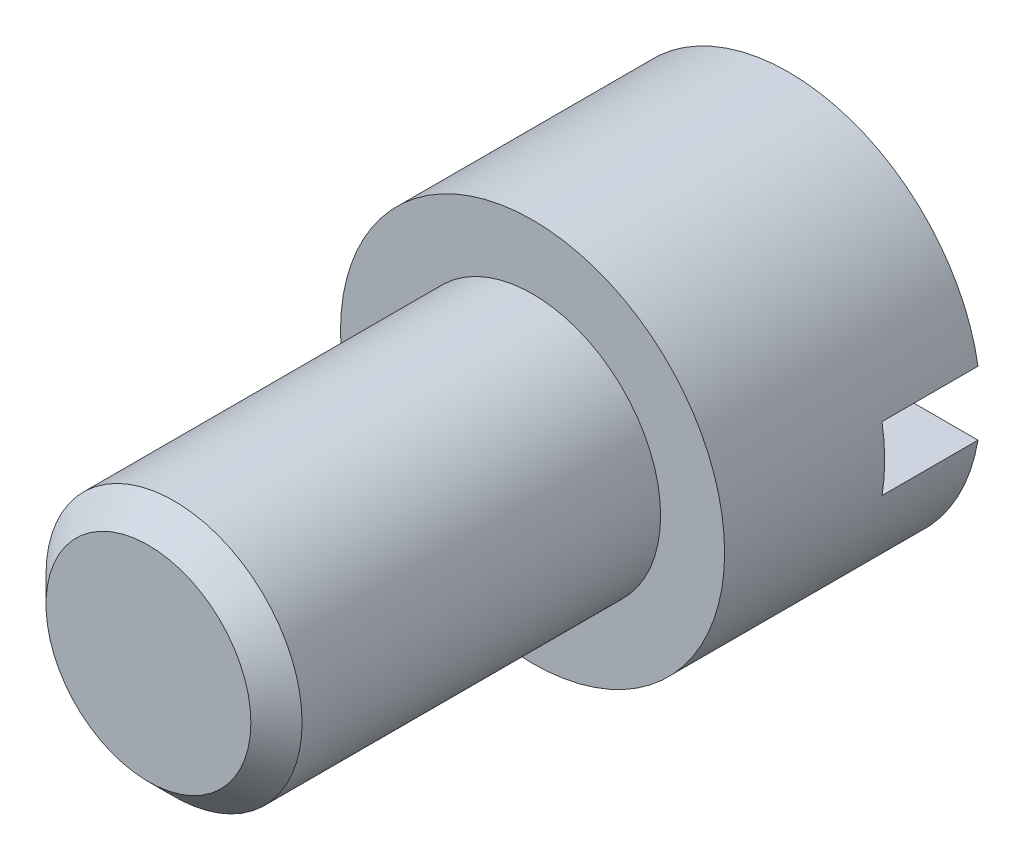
from build123d import *

# Parameters (mm, degrees)
ESQUISSE2_R             = 1
BOSS_EXTRU_1_DEPTH      = 3
CHANFREIN1_SIZE         = 0.2
ESQUISSE3_R             = 1.5
BOSS_EXTRU_2_DEPTH      = 2
ESQUISSE6_W             = 4
ESQUISSE6_H             = 0.5
ENL_V_MAT_EXTRU_3_DEPTH = 0.75


with BuildPart() as part:
    # Esquisse2 → Boss.-Extru.1 (new body)
    with BuildSketch(Plane.XY):
        Circle(ESQUISSE2_R)
    extrude(amount=BOSS_EXTRU_1_DEPTH)

    # Chanfrein1
    chanfrein1_edges = [part.edges().sort_by_distance(p)[0] for p in [
        (-1, 0, 3),
    ]]
    chamfer(chanfrein1_edges, length=CHANFREIN1_SIZE)

    # Esquisse3 → Boss.-Extru.2 (add)
    with BuildSketch(Plane(origin=(0, 0, 0), x_dir=(-1, 0, 0), z_dir=(0, 0, -1))):
        Circle(ESQUISSE3_R)
    extrude(amount=BOSS_EXTRU_2_DEPTH)

    # Esquisse6 → Enl_v. mat.-Extru.3 (cut)
    with BuildSketch(Plane(origin=(0, 0, -2), x_dir=(-1, 0, 0), z_dir=(0, 0, -1))):
        Rectangle(ESQUISSE6_W, ESQUISSE6_H)
    extrude(amount=-ENL_V_MAT_EXTRU_3_DEPTH, mode=Mode.SUBTRACT)


solid = part.part
